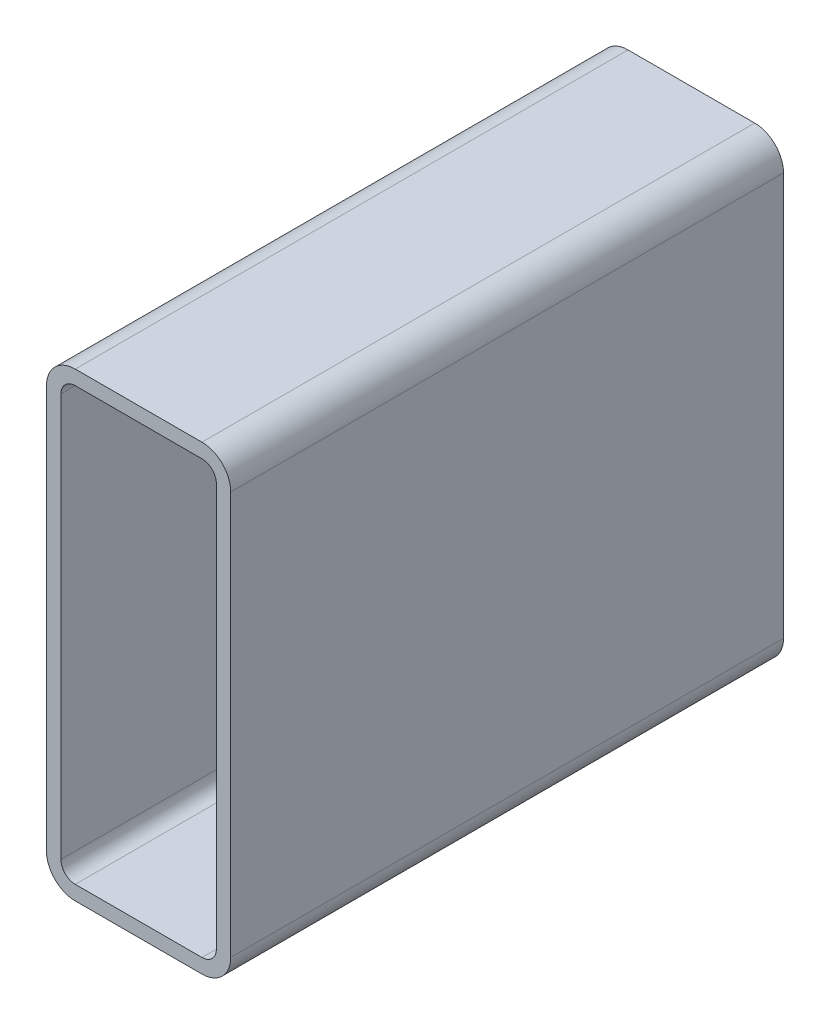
ISO-10303-21;
HEADER;
FILE_DESCRIPTION(('STEP AP214'),'2;1');
FILE_NAME('part.step','',(''),(''),'','','');
FILE_SCHEMA(('AUTOMOTIVE_DESIGN { 1 0 10303 214 1 1 1 1 }'));
ENDSEC;
DATA;
#1=APPLICATION_CONTEXT('core data for automotive mechanical design processes');
#2=APPLICATION_PROTOCOL_DEFINITION('international standard','automotive_design',2000,#1);
#3=PRODUCT_CONTEXT('',#1,'mechanical');
#4=PRODUCT('Part','Part','',(#3));
#5=PRODUCT_RELATED_PRODUCT_CATEGORY('part','',(#4));
#6=PRODUCT_DEFINITION_FORMATION('','',#4);
#7=PRODUCT_DEFINITION_CONTEXT('part definition',#1,'design');
#8=PRODUCT_DEFINITION('design','',#6,#7);
#9=PRODUCT_DEFINITION_SHAPE('','',#8);
#10=(LENGTH_UNIT() NAMED_UNIT(*) SI_UNIT(.MILLI.,.METRE.));
#11=(NAMED_UNIT(*) PLANE_ANGLE_UNIT() SI_UNIT($,.RADIAN.));
#12=(NAMED_UNIT(*) SI_UNIT($,.STERADIAN.) SOLID_ANGLE_UNIT());
#13=UNCERTAINTY_MEASURE_WITH_UNIT(LENGTH_MEASURE(1.E-05),#10,'distance_accuracy_value','');
#14=(GEOMETRIC_REPRESENTATION_CONTEXT(3) GLOBAL_UNCERTAINTY_ASSIGNED_CONTEXT((#13)) GLOBAL_UNIT_ASSIGNED_CONTEXT((#10,
#11,#12)) REPRESENTATION_CONTEXT('',''));
#15=CARTESIAN_POINT('',(0.,0.,0.));
#16=DIRECTION('',(0.,0.,1.));
#17=DIRECTION('',(1.,0.,0.));
#18=AXIS2_PLACEMENT_3D('',#15,#16,#17);
#19=CARTESIAN_POINT('',(17.5501778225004,240.045313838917,304.8));
#20=DIRECTION('',(0.,0.,1.));
#21=DIRECTION('',(1.,0.,0.));
#22=AXIS2_PLACEMENT_3D('',#19,#20,#21);
#23=PLANE('',#22);
#24=CARTESIAN_POINT('',(17.5501778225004,240.045313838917,304.8));
#25=DIRECTION('',(0.,0.,1.));
#26=DIRECTION('',(1.,0.,0.));
#27=AXIS2_PLACEMENT_3D('',#24,#25,#26);
#28=CIRCLE('',#27,15.875);
#29=CARTESIAN_POINT('',(17.5501778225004,255.920313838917,304.8));
#30=VERTEX_POINT('',#29);
#31=CARTESIAN_POINT('',(1.67517782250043,240.045313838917,304.8));
#32=VERTEX_POINT('',#31);
#33=EDGE_CURVE('E211',#30,#32,#28,.T.);
#34=ORIENTED_EDGE('',*,*,#33,.T.);
#35=DIRECTION('',(0.,-1.,0.));
#36=VECTOR('',#35,1.);
#37=CARTESIAN_POINT('',(1.67517782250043,17.7953138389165,304.8));
#38=LINE('',#37,#36);
#39=CARTESIAN_POINT('',(1.67517782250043,17.7953138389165,304.8));
#40=VERTEX_POINT('',#39);
#41=EDGE_CURVE('E214',#32,#40,#38,.T.);
#42=ORIENTED_EDGE('',*,*,#41,.T.);
#43=CARTESIAN_POINT('',(17.5501778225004,17.7953138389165,304.8));
#44=DIRECTION('',(0.,0.,1.));
#45=DIRECTION('',(1.,0.,0.));
#46=AXIS2_PLACEMENT_3D('',#43,#44,#45);
#47=CIRCLE('',#46,15.875);
#48=CARTESIAN_POINT('',(17.5501778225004,1.92031383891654,304.8));
#49=VERTEX_POINT('',#48);
#50=EDGE_CURVE('E217',#40,#49,#47,.T.);
#51=ORIENTED_EDGE('',*,*,#50,.T.);
#52=DIRECTION('',(1.,0.,0.));
#53=VECTOR('',#52,1.);
#54=CARTESIAN_POINT('',(87.4001778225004,1.92031383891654,304.8));
#55=LINE('',#54,#53);
#56=CARTESIAN_POINT('',(87.4001778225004,1.92031383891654,304.8));
#57=VERTEX_POINT('',#56);
#58=EDGE_CURVE('E219',#49,#57,#55,.T.);
#59=ORIENTED_EDGE('',*,*,#58,.T.);
#60=CARTESIAN_POINT('',(87.4001778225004,17.7953138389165,304.8));
#61=DIRECTION('',(0.,0.,1.));
#62=DIRECTION('',(1.,0.,0.));
#63=AXIS2_PLACEMENT_3D('',#60,#61,#62);
#64=CIRCLE('',#63,15.875);
#65=CARTESIAN_POINT('',(103.2751778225,17.7953138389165,304.8));
#66=VERTEX_POINT('',#65);
#67=EDGE_CURVE('E221',#57,#66,#64,.T.);
#68=ORIENTED_EDGE('',*,*,#67,.T.);
#69=DIRECTION('',(0.,1.,0.));
#70=VECTOR('',#69,1.);
#71=CARTESIAN_POINT('',(103.2751778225,240.045313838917,304.8));
#72=LINE('',#71,#70);
#73=CARTESIAN_POINT('',(103.2751778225,240.045313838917,304.8));
#74=VERTEX_POINT('',#73);
#75=EDGE_CURVE('E223',#66,#74,#72,.T.);
#76=ORIENTED_EDGE('',*,*,#75,.T.);
#77=CARTESIAN_POINT('',(87.4001778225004,240.045313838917,304.8));
#78=DIRECTION('',(0.,0.,1.));
#79=DIRECTION('',(1.,0.,0.));
#80=AXIS2_PLACEMENT_3D('',#77,#78,#79);
#81=CIRCLE('',#80,15.875);
#82=CARTESIAN_POINT('',(87.4001778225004,255.920313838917,304.8));
#83=VERTEX_POINT('',#82);
#84=EDGE_CURVE('E225',#74,#83,#81,.T.);
#85=ORIENTED_EDGE('',*,*,#84,.T.);
#86=DIRECTION('',(-1.,0.,0.));
#87=VECTOR('',#86,1.);
#88=CARTESIAN_POINT('',(17.5501778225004,255.920313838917,304.8));
#89=LINE('',#88,#87);
#90=EDGE_CURVE('E227',#83,#30,#89,.T.);
#91=ORIENTED_EDGE('',*,*,#90,.T.);
#92=EDGE_LOOP('',(#34,#42,#51,#59,#68,#76,#85,#91));
#93=FACE_BOUND('',#92,.T.);
#94=DIRECTION('',(0.,-1.,0.));
#95=VECTOR('',#94,1.);
#96=CARTESIAN_POINT('',(9.61267782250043,17.7953138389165,304.8));
#97=LINE('',#96,#95);
#98=CARTESIAN_POINT('',(9.61267782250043,240.045313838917,304.8));
#99=VERTEX_POINT('',#98);
#100=CARTESIAN_POINT('',(9.61267782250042,17.7953138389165,304.8));
#101=VERTEX_POINT('',#100);
#102=EDGE_CURVE('E154',#99,#101,#97,.T.);
#103=ORIENTED_EDGE('',*,*,#102,.F.);
#104=CARTESIAN_POINT('',(17.5501778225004,240.045313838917,304.8));
#105=DIRECTION('',(0.,0.,1.));
#106=DIRECTION('',(1.,0.,0.));
#107=AXIS2_PLACEMENT_3D('',#104,#105,#106);
#108=CIRCLE('',#107,7.9375);
#109=CARTESIAN_POINT('',(17.5501778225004,247.982813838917,304.8));
#110=VERTEX_POINT('',#109);
#111=EDGE_CURVE('E146',#110,#99,#108,.T.);
#112=ORIENTED_EDGE('',*,*,#111,.F.);
#113=DIRECTION('',(-1.,0.,0.));
#114=VECTOR('',#113,1.);
#115=CARTESIAN_POINT('',(17.5501778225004,247.982813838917,304.8));
#116=LINE('',#115,#114);
#117=CARTESIAN_POINT('',(87.4001778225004,247.982813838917,304.8));
#118=VERTEX_POINT('',#117);
#119=EDGE_CURVE('E179',#118,#110,#116,.T.);
#120=ORIENTED_EDGE('',*,*,#119,.F.);
#121=CARTESIAN_POINT('',(87.4001778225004,240.045313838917,304.8));
#122=DIRECTION('',(0.,0.,1.));
#123=DIRECTION('',(1.,0.,0.));
#124=AXIS2_PLACEMENT_3D('',#121,#122,#123);
#125=CIRCLE('',#124,7.93749999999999);
#126=CARTESIAN_POINT('',(95.3376778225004,240.045313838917,304.8));
#127=VERTEX_POINT('',#126);
#128=EDGE_CURVE('E177',#127,#118,#125,.T.);
#129=ORIENTED_EDGE('',*,*,#128,.F.);
#130=DIRECTION('',(0.,1.,0.));
#131=VECTOR('',#130,1.);
#132=CARTESIAN_POINT('',(95.3376778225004,240.045313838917,304.8));
#133=LINE('',#132,#131);
#134=CARTESIAN_POINT('',(95.3376778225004,17.7953138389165,304.8));
#135=VERTEX_POINT('',#134);
#136=EDGE_CURVE('E175',#135,#127,#133,.T.);
#137=ORIENTED_EDGE('',*,*,#136,.F.);
#138=CARTESIAN_POINT('',(87.4001778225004,17.7953138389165,304.8));
#139=DIRECTION('',(0.,0.,1.));
#140=DIRECTION('',(1.,0.,0.));
#141=AXIS2_PLACEMENT_3D('',#138,#139,#140);
#142=CIRCLE('',#141,7.9375);
#143=CARTESIAN_POINT('',(87.4001778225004,9.85781383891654,304.8));
#144=VERTEX_POINT('',#143);
#145=EDGE_CURVE('E173',#144,#135,#142,.T.);
#146=ORIENTED_EDGE('',*,*,#145,.F.);
#147=DIRECTION('',(1.,0.,0.));
#148=VECTOR('',#147,1.);
#149=CARTESIAN_POINT('',(87.4001778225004,9.85781383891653,304.8));
#150=LINE('',#149,#148);
#151=CARTESIAN_POINT('',(17.5501778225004,9.85781383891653,304.8));
#152=VERTEX_POINT('',#151);
#153=EDGE_CURVE('E169',#152,#144,#150,.T.);
#154=ORIENTED_EDGE('',*,*,#153,.F.);
#155=CARTESIAN_POINT('',(17.5501778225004,17.7953138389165,304.8));
#156=DIRECTION('',(0.,0.,1.));
#157=DIRECTION('',(1.,0.,0.));
#158=AXIS2_PLACEMENT_3D('',#155,#156,#157);
#159=CIRCLE('',#158,7.9375);
#160=EDGE_CURVE('E167',#101,#152,#159,.T.);
#161=ORIENTED_EDGE('',*,*,#160,.F.);
#162=EDGE_LOOP('',(#103,#112,#120,#129,#137,#146,#154,#161));
#163=FACE_BOUND('',#162,.T.);
#164=ADVANCED_FACE('F33',(#93,#163),#23,.T.);
#165=CARTESIAN_POINT('',(17.5501778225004,240.045313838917,0.));
#166=DIRECTION('',(0.,0.,1.));
#167=DIRECTION('',(1.,0.,0.));
#168=AXIS2_PLACEMENT_3D('',#165,#166,#167);
#169=PLANE('',#168);
#170=CARTESIAN_POINT('',(17.5501778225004,240.045313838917,0.));
#171=DIRECTION('',(0.,0.,1.));
#172=DIRECTION('',(1.,0.,0.));
#173=AXIS2_PLACEMENT_3D('',#170,#171,#172);
#174=CIRCLE('',#173,15.875);
#175=CARTESIAN_POINT('',(17.5501778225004,255.920313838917,0.));
#176=VERTEX_POINT('',#175);
#177=CARTESIAN_POINT('',(1.67517782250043,240.045313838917,0.));
#178=VERTEX_POINT('',#177);
#179=EDGE_CURVE('E162',#176,#178,#174,.T.);
#180=ORIENTED_EDGE('',*,*,#179,.F.);
#181=DIRECTION('',(-1.,0.,0.));
#182=VECTOR('',#181,1.);
#183=CARTESIAN_POINT('',(17.5501778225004,255.920313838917,0.));
#184=LINE('',#183,#182);
#185=CARTESIAN_POINT('',(87.4001778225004,255.920313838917,0.));
#186=VERTEX_POINT('',#185);
#187=EDGE_CURVE('E215',#186,#176,#184,.T.);
#188=ORIENTED_EDGE('',*,*,#187,.F.);
#189=CARTESIAN_POINT('',(87.4001778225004,240.045313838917,0.));
#190=DIRECTION('',(0.,0.,1.));
#191=DIRECTION('',(1.,0.,0.));
#192=AXIS2_PLACEMENT_3D('',#189,#190,#191);
#193=CIRCLE('',#192,15.875);
#194=CARTESIAN_POINT('',(103.2751778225,240.045313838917,0.));
#195=VERTEX_POINT('',#194);
#196=EDGE_CURVE('E242',#195,#186,#193,.T.);
#197=ORIENTED_EDGE('',*,*,#196,.F.);
#198=DIRECTION('',(0.,1.,0.));
#199=VECTOR('',#198,1.);
#200=CARTESIAN_POINT('',(103.2751778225,240.045313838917,0.));
#201=LINE('',#200,#199);
#202=CARTESIAN_POINT('',(103.2751778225,17.7953138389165,0.));
#203=VERTEX_POINT('',#202);
#204=EDGE_CURVE('E240',#203,#195,#201,.T.);
#205=ORIENTED_EDGE('',*,*,#204,.F.);
#206=CARTESIAN_POINT('',(87.4001778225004,17.7953138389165,0.));
#207=DIRECTION('',(0.,0.,1.));
#208=DIRECTION('',(1.,0.,0.));
#209=AXIS2_PLACEMENT_3D('',#206,#207,#208);
#210=CIRCLE('',#209,15.875);
#211=CARTESIAN_POINT('',(87.4001778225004,1.92031383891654,0.));
#212=VERTEX_POINT('',#211);
#213=EDGE_CURVE('E238',#212,#203,#210,.T.);
#214=ORIENTED_EDGE('',*,*,#213,.F.);
#215=DIRECTION('',(1.,0.,0.));
#216=VECTOR('',#215,1.);
#217=CARTESIAN_POINT('',(87.4001778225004,1.92031383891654,0.));
#218=LINE('',#217,#216);
#219=CARTESIAN_POINT('',(17.5501778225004,1.92031383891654,0.));
#220=VERTEX_POINT('',#219);
#221=EDGE_CURVE('E236',#220,#212,#218,.T.);
#222=ORIENTED_EDGE('',*,*,#221,.F.);
#223=CARTESIAN_POINT('',(17.5501778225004,17.7953138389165,0.));
#224=DIRECTION('',(0.,0.,1.));
#225=DIRECTION('',(1.,0.,0.));
#226=AXIS2_PLACEMENT_3D('',#223,#224,#225);
#227=CIRCLE('',#226,15.875);
#228=CARTESIAN_POINT('',(1.67517782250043,17.7953138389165,0.));
#229=VERTEX_POINT('',#228);
#230=EDGE_CURVE('E234',#229,#220,#227,.T.);
#231=ORIENTED_EDGE('',*,*,#230,.F.);
#232=DIRECTION('',(0.,-1.,0.));
#233=VECTOR('',#232,1.);
#234=CARTESIAN_POINT('',(1.67517782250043,17.7953138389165,0.));
#235=LINE('',#234,#233);
#236=EDGE_CURVE('E232',#178,#229,#235,.T.);
#237=ORIENTED_EDGE('',*,*,#236,.F.);
#238=EDGE_LOOP('',(#180,#188,#197,#205,#214,#222,#231,#237));
#239=FACE_BOUND('',#238,.T.);
#240=CARTESIAN_POINT('',(17.5501778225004,240.045313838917,0.));
#241=DIRECTION('',(0.,0.,1.));
#242=DIRECTION('',(1.,0.,0.));
#243=AXIS2_PLACEMENT_3D('',#240,#241,#242);
#244=CIRCLE('',#243,7.9375);
#245=CARTESIAN_POINT('',(17.5501778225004,247.982813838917,0.));
#246=VERTEX_POINT('',#245);
#247=CARTESIAN_POINT('',(9.61267782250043,240.045313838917,0.));
#248=VERTEX_POINT('',#247);
#249=EDGE_CURVE('E56',#246,#248,#244,.T.);
#250=ORIENTED_EDGE('',*,*,#249,.T.);
#251=DIRECTION('',(0.,-1.,0.));
#252=VECTOR('',#251,1.);
#253=CARTESIAN_POINT('',(9.61267782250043,17.7953138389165,0.));
#254=LINE('',#253,#252);
#255=CARTESIAN_POINT('',(9.61267782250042,17.7953138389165,0.));
#256=VERTEX_POINT('',#255);
#257=EDGE_CURVE('E161',#248,#256,#254,.T.);
#258=ORIENTED_EDGE('',*,*,#257,.T.);
#259=CARTESIAN_POINT('',(17.5501778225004,17.7953138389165,0.));
#260=DIRECTION('',(0.,0.,1.));
#261=DIRECTION('',(1.,0.,0.));
#262=AXIS2_PLACEMENT_3D('',#259,#260,#261);
#263=CIRCLE('',#262,7.9375);
#264=CARTESIAN_POINT('',(17.5501778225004,9.85781383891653,0.));
#265=VERTEX_POINT('',#264);
#266=EDGE_CURVE('E183',#256,#265,#263,.T.);
#267=ORIENTED_EDGE('',*,*,#266,.T.);
#268=DIRECTION('',(1.,0.,0.));
#269=VECTOR('',#268,1.);
#270=CARTESIAN_POINT('',(87.4001778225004,9.85781383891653,0.));
#271=LINE('',#270,#269);
#272=CARTESIAN_POINT('',(87.4001778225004,9.85781383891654,0.));
#273=VERTEX_POINT('',#272);
#274=EDGE_CURVE('E186',#265,#273,#271,.T.);
#275=ORIENTED_EDGE('',*,*,#274,.T.);
#276=CARTESIAN_POINT('',(87.4001778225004,17.7953138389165,0.));
#277=DIRECTION('',(0.,0.,1.));
#278=DIRECTION('',(1.,0.,0.));
#279=AXIS2_PLACEMENT_3D('',#276,#277,#278);
#280=CIRCLE('',#279,7.9375);
#281=CARTESIAN_POINT('',(95.3376778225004,17.7953138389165,0.));
#282=VERTEX_POINT('',#281);
#283=EDGE_CURVE('E189',#273,#282,#280,.T.);
#284=ORIENTED_EDGE('',*,*,#283,.T.);
#285=DIRECTION('',(0.,1.,0.));
#286=VECTOR('',#285,1.);
#287=CARTESIAN_POINT('',(95.3376778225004,240.045313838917,0.));
#288=LINE('',#287,#286);
#289=CARTESIAN_POINT('',(95.3376778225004,240.045313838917,0.));
#290=VERTEX_POINT('',#289);
#291=EDGE_CURVE('E192',#282,#290,#288,.T.);
#292=ORIENTED_EDGE('',*,*,#291,.T.);
#293=CARTESIAN_POINT('',(87.4001778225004,240.045313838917,0.));
#294=DIRECTION('',(0.,0.,1.));
#295=DIRECTION('',(1.,0.,0.));
#296=AXIS2_PLACEMENT_3D('',#293,#294,#295);
#297=CIRCLE('',#296,7.93749999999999);
#298=CARTESIAN_POINT('',(87.4001778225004,247.982813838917,0.));
#299=VERTEX_POINT('',#298);
#300=EDGE_CURVE('E195',#290,#299,#297,.T.);
#301=ORIENTED_EDGE('',*,*,#300,.T.);
#302=DIRECTION('',(-1.,0.,0.));
#303=VECTOR('',#302,1.);
#304=CARTESIAN_POINT('',(17.5501778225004,247.982813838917,0.));
#305=LINE('',#304,#303);
#306=EDGE_CURVE('E155',#299,#246,#305,.T.);
#307=ORIENTED_EDGE('',*,*,#306,.T.);
#308=EDGE_LOOP('',(#250,#258,#267,#275,#284,#292,#301,#307));
#309=FACE_BOUND('',#308,.T.);
#310=ADVANCED_FACE('F272',(#239,#309),#169,.F.);
#311=CARTESIAN_POINT('',(17.5501778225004,240.045313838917,304.8));
#312=DIRECTION('',(0.,0.,-1.));
#313=DIRECTION('',(-1.,0.,0.));
#314=AXIS2_PLACEMENT_3D('',#311,#312,#313);
#315=CYLINDRICAL_SURFACE('',#314,15.875);
#316=ORIENTED_EDGE('',*,*,#179,.T.);
#317=DIRECTION('',(0.,0.,-1.));
#318=VECTOR('',#317,1.);
#319=CARTESIAN_POINT('',(1.67517782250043,240.045313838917,304.8));
#320=LINE('',#319,#318);
#321=EDGE_CURVE('E11',#32,#178,#320,.T.);
#322=ORIENTED_EDGE('',*,*,#321,.F.);
#323=ORIENTED_EDGE('',*,*,#33,.F.);
#324=DIRECTION('',(0.,0.,-1.));
#325=VECTOR('',#324,1.);
#326=CARTESIAN_POINT('',(17.5501778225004,255.920313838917,304.8));
#327=LINE('',#326,#325);
#328=EDGE_CURVE('E229',#30,#176,#327,.T.);
#329=ORIENTED_EDGE('',*,*,#328,.T.);
#330=EDGE_LOOP('',(#316,#322,#323,#329));
#331=FACE_BOUND('',#330,.T.);
#332=ADVANCED_FACE('F35',(#331),#315,.T.);
#333=CARTESIAN_POINT('',(1.67517782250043,17.7953138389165,304.8));
#334=DIRECTION('',(1.,0.,0.));
#335=DIRECTION('',(0.,0.,-1.));
#336=AXIS2_PLACEMENT_3D('',#333,#334,#335);
#337=PLANE('',#336);
#338=ORIENTED_EDGE('',*,*,#236,.T.);
#339=DIRECTION('',(0.,0.,-1.));
#340=VECTOR('',#339,1.);
#341=CARTESIAN_POINT('',(1.67517782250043,17.7953138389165,304.8));
#342=LINE('',#341,#340);
#343=EDGE_CURVE('E41',#40,#229,#342,.T.);
#344=ORIENTED_EDGE('',*,*,#343,.F.);
#345=ORIENTED_EDGE('',*,*,#41,.F.);
#346=ORIENTED_EDGE('',*,*,#321,.T.);
#347=EDGE_LOOP('',(#338,#344,#345,#346));
#348=FACE_BOUND('',#347,.T.);
#349=ADVANCED_FACE('F289',(#348),#337,.F.);
#350=CARTESIAN_POINT('',(17.5501778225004,17.7953138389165,304.8));
#351=DIRECTION('',(0.,0.,-1.));
#352=DIRECTION('',(-1.,0.,0.));
#353=AXIS2_PLACEMENT_3D('',#350,#351,#352);
#354=CYLINDRICAL_SURFACE('',#353,15.875);
#355=ORIENTED_EDGE('',*,*,#230,.T.);
#356=DIRECTION('',(0.,0.,-1.));
#357=VECTOR('',#356,1.);
#358=CARTESIAN_POINT('',(17.5501778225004,1.92031383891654,304.8));
#359=LINE('',#358,#357);
#360=EDGE_CURVE('E259',#49,#220,#359,.T.);
#361=ORIENTED_EDGE('',*,*,#360,.F.);
#362=ORIENTED_EDGE('',*,*,#50,.F.);
#363=ORIENTED_EDGE('',*,*,#343,.T.);
#364=EDGE_LOOP('',(#355,#361,#362,#363));
#365=FACE_BOUND('',#364,.T.);
#366=ADVANCED_FACE('F266',(#365),#354,.T.);
#367=CARTESIAN_POINT('',(87.4001778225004,1.92031383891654,304.8));
#368=DIRECTION('',(0.,1.,0.));
#369=DIRECTION('',(0.,0.,1.));
#370=AXIS2_PLACEMENT_3D('',#367,#368,#369);
#371=PLANE('',#370);
#372=ORIENTED_EDGE('',*,*,#221,.T.);
#373=DIRECTION('',(0.,0.,-1.));
#374=VECTOR('',#373,1.);
#375=CARTESIAN_POINT('',(87.4001778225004,1.92031383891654,304.8));
#376=LINE('',#375,#374);
#377=EDGE_CURVE('E256',#57,#212,#376,.T.);
#378=ORIENTED_EDGE('',*,*,#377,.F.);
#379=ORIENTED_EDGE('',*,*,#58,.F.);
#380=ORIENTED_EDGE('',*,*,#360,.T.);
#381=EDGE_LOOP('',(#372,#378,#379,#380));
#382=FACE_BOUND('',#381,.T.);
#383=ADVANCED_FACE('F278',(#382),#371,.F.);
#384=CARTESIAN_POINT('',(87.4001778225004,17.7953138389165,304.8));
#385=DIRECTION('',(0.,0.,-1.));
#386=DIRECTION('',(-1.,0.,0.));
#387=AXIS2_PLACEMENT_3D('',#384,#385,#386);
#388=CYLINDRICAL_SURFACE('',#387,15.875);
#389=ORIENTED_EDGE('',*,*,#213,.T.);
#390=DIRECTION('',(0.,0.,-1.));
#391=VECTOR('',#390,1.);
#392=CARTESIAN_POINT('',(103.2751778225,17.7953138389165,304.8));
#393=LINE('',#392,#391);
#394=EDGE_CURVE('E253',#66,#203,#393,.T.);
#395=ORIENTED_EDGE('',*,*,#394,.F.);
#396=ORIENTED_EDGE('',*,*,#67,.F.);
#397=ORIENTED_EDGE('',*,*,#377,.T.);
#398=EDGE_LOOP('',(#389,#395,#396,#397));
#399=FACE_BOUND('',#398,.T.);
#400=ADVANCED_FACE('F282',(#399),#388,.T.);
#401=CARTESIAN_POINT('',(103.2751778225,240.045313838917,304.8));
#402=DIRECTION('',(-1.,0.,0.));
#403=DIRECTION('',(0.,0.,1.));
#404=AXIS2_PLACEMENT_3D('',#401,#402,#403);
#405=PLANE('',#404);
#406=ORIENTED_EDGE('',*,*,#204,.T.);
#407=DIRECTION('',(0.,0.,-1.));
#408=VECTOR('',#407,1.);
#409=CARTESIAN_POINT('',(103.2751778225,240.045313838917,304.8));
#410=LINE('',#409,#408);
#411=EDGE_CURVE('E250',#74,#195,#410,.T.);
#412=ORIENTED_EDGE('',*,*,#411,.F.);
#413=ORIENTED_EDGE('',*,*,#75,.F.);
#414=ORIENTED_EDGE('',*,*,#394,.T.);
#415=EDGE_LOOP('',(#406,#412,#413,#414));
#416=FACE_BOUND('',#415,.T.);
#417=ADVANCED_FACE('F302',(#416),#405,.F.);
#418=CARTESIAN_POINT('',(87.4001778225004,240.045313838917,304.8));
#419=DIRECTION('',(0.,0.,-1.));
#420=DIRECTION('',(-1.,0.,0.));
#421=AXIS2_PLACEMENT_3D('',#418,#419,#420);
#422=CYLINDRICAL_SURFACE('',#421,15.875);
#423=ORIENTED_EDGE('',*,*,#196,.T.);
#424=DIRECTION('',(0.,0.,-1.));
#425=VECTOR('',#424,1.);
#426=CARTESIAN_POINT('',(87.4001778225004,255.920313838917,304.8));
#427=LINE('',#426,#425);
#428=EDGE_CURVE('E247',#83,#186,#427,.T.);
#429=ORIENTED_EDGE('',*,*,#428,.F.);
#430=ORIENTED_EDGE('',*,*,#84,.F.);
#431=ORIENTED_EDGE('',*,*,#411,.T.);
#432=EDGE_LOOP('',(#423,#429,#430,#431));
#433=FACE_BOUND('',#432,.T.);
#434=ADVANCED_FACE('F300',(#433),#422,.T.);
#435=CARTESIAN_POINT('',(17.5501778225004,255.920313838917,304.8));
#436=DIRECTION('',(0.,-1.,0.));
#437=DIRECTION('',(0.,0.,-1.));
#438=AXIS2_PLACEMENT_3D('',#435,#436,#437);
#439=PLANE('',#438);
#440=ORIENTED_EDGE('',*,*,#187,.T.);
#441=ORIENTED_EDGE('',*,*,#328,.F.);
#442=ORIENTED_EDGE('',*,*,#90,.F.);
#443=ORIENTED_EDGE('',*,*,#428,.T.);
#444=EDGE_LOOP('',(#440,#441,#442,#443));
#445=FACE_BOUND('',#444,.T.);
#446=ADVANCED_FACE('F295',(#445),#439,.F.);
#447=CARTESIAN_POINT('',(17.5501778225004,240.045313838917,304.8));
#448=DIRECTION('',(0.,0.,-1.));
#449=DIRECTION('',(-1.,0.,0.));
#450=AXIS2_PLACEMENT_3D('',#447,#448,#449);
#451=CYLINDRICAL_SURFACE('',#450,7.9375);
#452=ORIENTED_EDGE('',*,*,#249,.F.);
#453=DIRECTION('',(0.,0.,-1.));
#454=VECTOR('',#453,1.);
#455=CARTESIAN_POINT('',(17.5501778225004,247.982813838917,304.8));
#456=LINE('',#455,#454);
#457=EDGE_CURVE('E150',#110,#246,#456,.T.);
#458=ORIENTED_EDGE('',*,*,#457,.F.);
#459=ORIENTED_EDGE('',*,*,#111,.T.);
#460=DIRECTION('',(0.,0.,-1.));
#461=VECTOR('',#460,1.);
#462=CARTESIAN_POINT('',(9.61267782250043,240.045313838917,304.8));
#463=LINE('',#462,#461);
#464=EDGE_CURVE('E149',#99,#248,#463,.T.);
#465=ORIENTED_EDGE('',*,*,#464,.T.);
#466=EDGE_LOOP('',(#452,#458,#459,#465));
#467=FACE_BOUND('',#466,.T.);
#468=ADVANCED_FACE('F148',(#467),#451,.F.);
#469=CARTESIAN_POINT('',(9.61267782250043,17.7953138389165,304.8));
#470=DIRECTION('',(1.,0.,0.));
#471=DIRECTION('',(0.,0.,-1.));
#472=AXIS2_PLACEMENT_3D('',#469,#470,#471);
#473=PLANE('',#472);
#474=ORIENTED_EDGE('',*,*,#257,.F.);
#475=ORIENTED_EDGE('',*,*,#464,.F.);
#476=ORIENTED_EDGE('',*,*,#102,.T.);
#477=DIRECTION('',(0.,0.,-1.));
#478=VECTOR('',#477,1.);
#479=CARTESIAN_POINT('',(9.61267782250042,17.7953138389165,304.8));
#480=LINE('',#479,#478);
#481=EDGE_CURVE('E163',#101,#256,#480,.T.);
#482=ORIENTED_EDGE('',*,*,#481,.T.);
#483=EDGE_LOOP('',(#474,#475,#476,#482));
#484=FACE_BOUND('',#483,.T.);
#485=ADVANCED_FACE('F158',(#484),#473,.T.);
#486=CARTESIAN_POINT('',(17.5501778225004,17.7953138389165,304.8));
#487=DIRECTION('',(0.,0.,-1.));
#488=DIRECTION('',(-1.,0.,0.));
#489=AXIS2_PLACEMENT_3D('',#486,#487,#488);
#490=CYLINDRICAL_SURFACE('',#489,7.9375);
#491=ORIENTED_EDGE('',*,*,#266,.F.);
#492=ORIENTED_EDGE('',*,*,#481,.F.);
#493=ORIENTED_EDGE('',*,*,#160,.T.);
#494=DIRECTION('',(0.,0.,-1.));
#495=VECTOR('',#494,1.);
#496=CARTESIAN_POINT('',(17.5501778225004,9.85781383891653,304.8));
#497=LINE('',#496,#495);
#498=EDGE_CURVE('E208',#152,#265,#497,.T.);
#499=ORIENTED_EDGE('',*,*,#498,.T.);
#500=EDGE_LOOP('',(#491,#492,#493,#499));
#501=FACE_BOUND('',#500,.T.);
#502=ADVANCED_FACE('F327',(#501),#490,.F.);
#503=CARTESIAN_POINT('',(87.4001778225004,9.85781383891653,304.8));
#504=DIRECTION('',(0.,1.,0.));
#505=DIRECTION('',(0.,0.,1.));
#506=AXIS2_PLACEMENT_3D('',#503,#504,#505);
#507=PLANE('',#506);
#508=ORIENTED_EDGE('',*,*,#274,.F.);
#509=ORIENTED_EDGE('',*,*,#498,.F.);
#510=ORIENTED_EDGE('',*,*,#153,.T.);
#511=DIRECTION('',(0.,0.,-1.));
#512=VECTOR('',#511,1.);
#513=CARTESIAN_POINT('',(87.4001778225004,9.85781383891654,304.8));
#514=LINE('',#513,#512);
#515=EDGE_CURVE('E206',#144,#273,#514,.T.);
#516=ORIENTED_EDGE('',*,*,#515,.T.);
#517=EDGE_LOOP('',(#508,#509,#510,#516));
#518=FACE_BOUND('',#517,.T.);
#519=ADVANCED_FACE('F331',(#518),#507,.T.);
#520=CARTESIAN_POINT('',(87.4001778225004,17.7953138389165,304.8));
#521=DIRECTION('',(0.,0.,-1.));
#522=DIRECTION('',(-1.,0.,0.));
#523=AXIS2_PLACEMENT_3D('',#520,#521,#522);
#524=CYLINDRICAL_SURFACE('',#523,7.9375);
#525=ORIENTED_EDGE('',*,*,#283,.F.);
#526=ORIENTED_EDGE('',*,*,#515,.F.);
#527=ORIENTED_EDGE('',*,*,#145,.T.);
#528=DIRECTION('',(0.,0.,-1.));
#529=VECTOR('',#528,1.);
#530=CARTESIAN_POINT('',(95.3376778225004,17.7953138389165,304.8));
#531=LINE('',#530,#529);
#532=EDGE_CURVE('E204',#135,#282,#531,.T.);
#533=ORIENTED_EDGE('',*,*,#532,.T.);
#534=EDGE_LOOP('',(#525,#526,#527,#533));
#535=FACE_BOUND('',#534,.T.);
#536=ADVANCED_FACE('F337',(#535),#524,.F.);
#537=CARTESIAN_POINT('',(95.3376778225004,240.045313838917,304.8));
#538=DIRECTION('',(-1.,0.,0.));
#539=DIRECTION('',(0.,0.,1.));
#540=AXIS2_PLACEMENT_3D('',#537,#538,#539);
#541=PLANE('',#540);
#542=ORIENTED_EDGE('',*,*,#291,.F.);
#543=ORIENTED_EDGE('',*,*,#532,.F.);
#544=ORIENTED_EDGE('',*,*,#136,.T.);
#545=DIRECTION('',(0.,0.,-1.));
#546=VECTOR('',#545,1.);
#547=CARTESIAN_POINT('',(95.3376778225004,240.045313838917,304.8));
#548=LINE('',#547,#546);
#549=EDGE_CURVE('E202',#127,#290,#548,.T.);
#550=ORIENTED_EDGE('',*,*,#549,.T.);
#551=EDGE_LOOP('',(#542,#543,#544,#550));
#552=FACE_BOUND('',#551,.T.);
#553=ADVANCED_FACE('F341',(#552),#541,.T.);
#554=CARTESIAN_POINT('',(87.4001778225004,240.045313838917,304.8));
#555=DIRECTION('',(0.,0.,-1.));
#556=DIRECTION('',(-1.,0.,0.));
#557=AXIS2_PLACEMENT_3D('',#554,#555,#556);
#558=CYLINDRICAL_SURFACE('',#557,7.93749999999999);
#559=ORIENTED_EDGE('',*,*,#300,.F.);
#560=ORIENTED_EDGE('',*,*,#549,.F.);
#561=ORIENTED_EDGE('',*,*,#128,.T.);
#562=DIRECTION('',(0.,0.,-1.));
#563=VECTOR('',#562,1.);
#564=CARTESIAN_POINT('',(87.4001778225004,247.982813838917,304.8));
#565=LINE('',#564,#563);
#566=EDGE_CURVE('E48',#118,#299,#565,.T.);
#567=ORIENTED_EDGE('',*,*,#566,.T.);
#568=EDGE_LOOP('',(#559,#560,#561,#567));
#569=FACE_BOUND('',#568,.T.);
#570=ADVANCED_FACE('F345',(#569),#558,.F.);
#571=CARTESIAN_POINT('',(17.5501778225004,247.982813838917,304.8));
#572=DIRECTION('',(0.,-1.,0.));
#573=DIRECTION('',(0.,0.,-1.));
#574=AXIS2_PLACEMENT_3D('',#571,#572,#573);
#575=PLANE('',#574);
#576=ORIENTED_EDGE('',*,*,#306,.F.);
#577=ORIENTED_EDGE('',*,*,#566,.F.);
#578=ORIENTED_EDGE('',*,*,#119,.T.);
#579=ORIENTED_EDGE('',*,*,#457,.T.);
#580=EDGE_LOOP('',(#576,#577,#578,#579));
#581=FACE_BOUND('',#580,.T.);
#582=ADVANCED_FACE('F349',(#581),#575,.T.);
#583=CLOSED_SHELL('',(#164,#310,#332,#349,#366,#383,#400,#417,#434,#446,#468,#485,#502,#519,
#536,#553,#570,#582));
#584=MANIFOLD_SOLID_BREP('B2',#583);
#585=ADVANCED_BREP_SHAPE_REPRESENTATION('',(#18,#584),#14);
#586=SHAPE_DEFINITION_REPRESENTATION(#9,#585);
ENDSEC;
END-ISO-10303-21;
